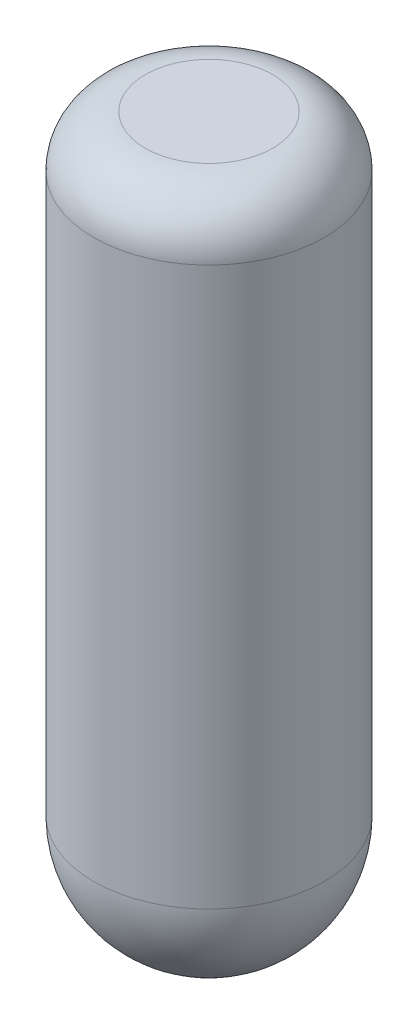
from build123d import *


with BuildPart() as part:
    # Sketch1 → Revolve1 (revolve)
    with BuildSketch(Plane.XY, mode=Mode.PRIVATE) as revolve1_sk:
        with BuildLine():
            Line((68.642526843, 324.085692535), (68.642526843, -7.816854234))
            ThreePointArc((68.642526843, -7.816854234), (48.537596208, -56.354450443), (0, -76.459381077))
            Line((0, -76.459381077), (0, 354.770075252))
            Line((0, 354.770075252), (37.958144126, 354.770075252))
            ThreePointArc((37.958144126, 354.770075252), (59.655279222, 345.782827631), (68.642526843, 324.085692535))
        make_face()
    revolve(revolve1_sk.sketch.rotate(Axis((0, 67.572844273, 0), (0, -1, 0)), 90), axis=Axis((0, 67.572844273, 0), (0, -1, 0)))


solid = part.part
